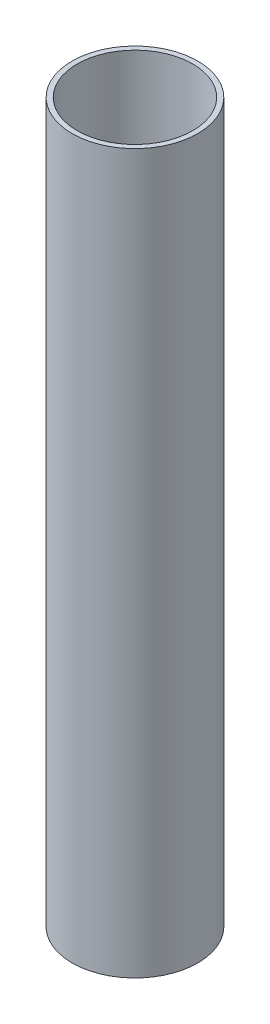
from build123d import *

# Parameters (mm, degrees)
SKETCH1_R           = 11.1125
SKETCH1_R_2         = 10.2235
EXTRUDE_THIN1_DEPTH = 63.5


with BuildPart() as part:
    # Sketch1 → Extrude-Thin1 (new, symmetric)
    with BuildSketch(Plane(origin=(0, 0, 0), x_dir=(1, 0, 0), z_dir=(0, 1, 0))):
        Circle(SKETCH1_R)
        Circle(SKETCH1_R_2, mode=Mode.SUBTRACT)
    extrude(amount=EXTRUDE_THIN1_DEPTH, both=True)


solid = part.part
